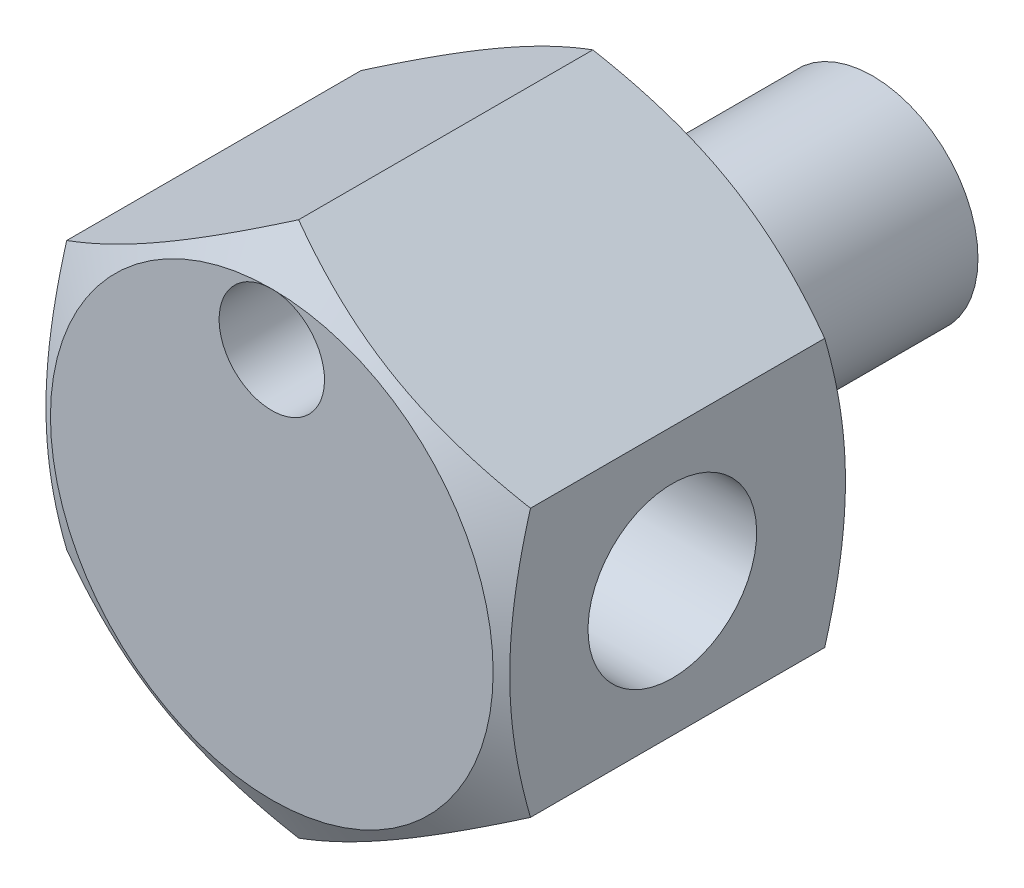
ISO-10303-21;
HEADER;
FILE_DESCRIPTION(('STEP AP214'),'2;1');
FILE_NAME('part.step','',(''),(''),'','','');
FILE_SCHEMA(('AUTOMOTIVE_DESIGN { 1 0 10303 214 1 1 1 1 }'));
ENDSEC;
DATA;
#1=APPLICATION_CONTEXT('core data for automotive mechanical design processes');
#2=APPLICATION_PROTOCOL_DEFINITION('international standard','automotive_design',2000,#1);
#3=PRODUCT_CONTEXT('',#1,'mechanical');
#4=PRODUCT('Part','Part','',(#3));
#5=PRODUCT_RELATED_PRODUCT_CATEGORY('part','',(#4));
#6=PRODUCT_DEFINITION_FORMATION('','',#4);
#7=PRODUCT_DEFINITION_CONTEXT('part definition',#1,'design');
#8=PRODUCT_DEFINITION('design','',#6,#7);
#9=PRODUCT_DEFINITION_SHAPE('','',#8);
#10=(LENGTH_UNIT() NAMED_UNIT(*) SI_UNIT(.MILLI.,.METRE.));
#11=(NAMED_UNIT(*) PLANE_ANGLE_UNIT() SI_UNIT($,.RADIAN.));
#12=(NAMED_UNIT(*) SI_UNIT($,.STERADIAN.) SOLID_ANGLE_UNIT());
#13=UNCERTAINTY_MEASURE_WITH_UNIT(LENGTH_MEASURE(1.E-05),#10,'distance_accuracy_value','');
#14=(GEOMETRIC_REPRESENTATION_CONTEXT(3) GLOBAL_UNCERTAINTY_ASSIGNED_CONTEXT((#13)) GLOBAL_UNIT_ASSIGNED_CONTEXT((#10,
#11,#12)) REPRESENTATION_CONTEXT('',''));
#15=CARTESIAN_POINT('',(0.,0.,0.));
#16=DIRECTION('',(0.,0.,1.));
#17=DIRECTION('',(1.,0.,0.));
#18=AXIS2_PLACEMENT_3D('',#15,#16,#17);
#19=CARTESIAN_POINT('',(-11.,0.,8.5));
#20=DIRECTION('',(-1.,0.,0.));
#21=DIRECTION('',(0.,-1.,0.));
#22=AXIS2_PLACEMENT_3D('',#19,#20,#21);
#23=CYLINDRICAL_SURFACE('',#22,4.);
#24=CARTESIAN_POINT('',(11.,0.,8.5));
#25=DIRECTION('',(-1.,0.,0.));
#26=DIRECTION('',(0.,-1.,0.));
#27=AXIS2_PLACEMENT_3D('',#24,#25,#26);
#28=CIRCLE('',#27,4.);
#29=CARTESIAN_POINT('',(11.,-4.,8.5));
#30=VERTEX_POINT('',#29);
#31=EDGE_CURVE('E370',#30,#30,#28,.T.);
#32=ORIENTED_EDGE('',*,*,#31,.F.);
#33=EDGE_LOOP('',(#32));
#34=FACE_BOUND('',#33,.T.);
#35=CARTESIAN_POINT('',(-11.,0.,8.5));
#36=DIRECTION('',(-1.,0.,0.));
#37=DIRECTION('',(0.,-1.,0.));
#38=AXIS2_PLACEMENT_3D('',#35,#36,#37);
#39=CIRCLE('',#38,4.);
#40=CARTESIAN_POINT('',(-11.,-4.,8.5));
#41=VERTEX_POINT('',#40);
#42=EDGE_CURVE('E367',#41,#41,#39,.T.);
#43=ORIENTED_EDGE('',*,*,#42,.T.);
#44=EDGE_LOOP('',(#43));
#45=FACE_BOUND('',#44,.T.);
#46=ADVANCED_FACE('F14',(#34,#45),#23,.F.);
#47=CARTESIAN_POINT('',(0.,0.,-12.));
#48=DIRECTION('',(0.,0.,-1.));
#49=DIRECTION('',(-1.,0.,0.));
#50=AXIS2_PLACEMENT_3D('',#47,#48,#49);
#51=PLANE('',#50);
#52=CARTESIAN_POINT('',(0.,0.,-12.));
#53=DIRECTION('',(0.,0.,-1.));
#54=DIRECTION('',(-1.,0.,0.));
#55=AXIS2_PLACEMENT_3D('',#52,#53,#54);
#56=CIRCLE('',#55,5.);
#57=CARTESIAN_POINT('',(-5.,0.,-12.));
#58=VERTEX_POINT('',#57);
#59=EDGE_CURVE('E364',#58,#58,#56,.T.);
#60=ORIENTED_EDGE('',*,*,#59,.T.);
#61=EDGE_LOOP('',(#60));
#62=FACE_BOUND('',#61,.T.);
#63=ADVANCED_FACE('F294',(#62),#51,.T.);
#64=CARTESIAN_POINT('',(11.,-6.35085296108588,16.5));
#65=DIRECTION('',(-1.,0.,0.));
#66=DIRECTION('',(0.,-1.,0.));
#67=AXIS2_PLACEMENT_3D('',#64,#65,#66);
#68=PLANE('',#67);
#69=ORIENTED_EDGE('',*,*,#31,.T.);
#70=EDGE_LOOP('',(#69));
#71=FACE_BOUND('',#70,.T.);
#72=DIRECTION('',(0.,0.,-1.));
#73=VECTOR('',#72,1.);
#74=CARTESIAN_POINT('',(11.,6.3508529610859,16.5));
#75=LINE('',#74,#73);
#76=CARTESIAN_POINT('',(11.,6.3508529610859,15.2288444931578));
#77=VERTEX_POINT('',#76);
#78=CARTESIAN_POINT('',(11.,6.3508529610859,1.27115550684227));
#79=VERTEX_POINT('',#78);
#80=EDGE_CURVE('E351',#77,#79,#75,.T.);
#81=ORIENTED_EDGE('',*,*,#80,.F.);
#82=CARTESIAN_POINT('',(11.,-16.803391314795,10.9668632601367));
#83=CARTESIAN_POINT('',(11.,-16.5620742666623,11.0834292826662));
#84=CARTESIAN_POINT('',(11.,-16.3204643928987,11.1993887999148));
#85=CARTESIAN_POINT('',(11.,-15.8365971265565,11.4299555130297));
#86=CARTESIAN_POINT('',(11.,-15.5943397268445,11.544562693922));
#87=CARTESIAN_POINT('',(11.,-14.8664318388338,11.8861802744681));
#88=CARTESIAN_POINT('',(11.,-14.379724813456,12.1109483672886));
#89=CARTESIAN_POINT('',(11.,-13.4001281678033,12.5543406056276));
#90=CARTESIAN_POINT('',(11.,-12.9072190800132,12.772921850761));
#91=CARTESIAN_POINT('',(11.,-11.917335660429,13.2006416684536));
#92=CARTESIAN_POINT('',(11.,-11.4203615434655,13.4097807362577));
#93=CARTESIAN_POINT('',(11.,-10.4155733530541,13.8185042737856));
#94=CARTESIAN_POINT('',(11.,-9.90770066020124,14.0179454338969));
#95=CARTESIAN_POINT('',(11.,-8.88595211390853,14.4011078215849));
#96=CARTESIAN_POINT('',(11.,-8.37207559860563,14.5848272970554));
#97=CARTESIAN_POINT('',(11.,-7.3385643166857,14.9315794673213));
#98=CARTESIAN_POINT('',(11.,-6.81894458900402,15.0946564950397));
#99=CARTESIAN_POINT('',(11.,-5.77233865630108,15.3948046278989));
#100=CARTESIAN_POINT('',(11.,-5.24535484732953,15.5318839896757));
#101=CARTESIAN_POINT('',(11.,-4.18355667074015,15.7733499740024));
#102=CARTESIAN_POINT('',(11.,-3.64873977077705,15.8777257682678));
#103=CARTESIAN_POINT('',(11.,-2.84184292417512,16.0045125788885));
#104=CARTESIAN_POINT('',(11.,-2.57206571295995,16.0418147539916));
#105=CARTESIAN_POINT('',(11.,-2.0312594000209,16.1057590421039));
#106=CARTESIAN_POINT('',(11.,-1.7602304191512,16.1324021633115));
#107=CARTESIAN_POINT('',(11.,-1.21898438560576,16.1743130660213));
#108=CARTESIAN_POINT('',(11.,-0.948772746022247,16.189650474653));
#109=CARTESIAN_POINT('',(11.,-0.40794323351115,16.2088695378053));
#110=CARTESIAN_POINT('',(11.,-0.137325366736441,16.2127513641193));
#111=CARTESIAN_POINT('',(11.,0.403755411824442,16.2089669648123));
#112=CARTESIAN_POINT('',(11.,0.674218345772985,16.2013039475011));
#113=CARTESIAN_POINT('',(11.,1.21458707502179,16.1746193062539));
#114=CARTESIAN_POINT('',(11.,1.48449283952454,16.1555970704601));
#115=CARTESIAN_POINT('',(11.,2.13975155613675,16.0960223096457));
#116=CARTESIAN_POINT('',(11.,2.52459164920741,16.0497180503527));
#117=CARTESIAN_POINT('',(11.,3.29123006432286,15.93660398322));
#118=CARTESIAN_POINT('',(11.,3.67302792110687,15.8697910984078));
#119=CARTESIAN_POINT('',(11.,4.81453751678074,15.6419434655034));
#120=CARTESIAN_POINT('',(11.,5.56887050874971,15.4536528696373));
#121=CARTESIAN_POINT('',(11.,6.69714810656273,15.1293211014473));
#122=CARTESIAN_POINT('',(11.,7.07699619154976,15.0126543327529));
#123=CARTESIAN_POINT('',(11.,7.83302288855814,14.7677701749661));
#124=CARTESIAN_POINT('',(11.,8.20920116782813,14.6395517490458));
#125=CARTESIAN_POINT('',(11.,8.95600996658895,14.3743055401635));
#126=CARTESIAN_POINT('',(11.,9.32665982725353,14.237331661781));
#127=CARTESIAN_POINT('',(11.,10.0648107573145,13.9555037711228));
#128=CARTESIAN_POINT('',(11.,10.4323128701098,13.8106524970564));
#129=CARTESIAN_POINT('',(11.,10.7984905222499,13.6626011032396));
#130=B_SPLINE_CURVE_WITH_KNOTS('',3,(#82,#83,#84,#85,#86,#87,#88,#89,#90,#91,#92,#93,#94,#95,
#96,#97,#98,#99,#100,#101,#102,#103,#104,#105,#106,#107,#108,#109,#110,#111,#112,#113,#114,#115,
#116,#117,#118,#119,#120,#121,#122,#123,#124,#125,#126,#127,#128,#129),.UNSPECIFIED.,.F.,.F.,(4,
2,2,2,2,2,2,2,2,2,2,2,2,2,2,2,2,2,2,2,2,2,2,4),(0.,0.803984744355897,1.60797838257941,
3.21622949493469,4.83375407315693,6.45119371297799,8.08788018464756,9.72474882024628,
11.3580401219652,12.9908118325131,14.6241235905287,15.4409776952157,16.2577545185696,
17.0694581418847,17.8811495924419,18.6926155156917,19.5041251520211,20.6663113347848,
21.8286719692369,24.1578810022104,25.3498722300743,26.5419705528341,27.7273290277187,
28.912278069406),.UNSPECIFIED.);
#131=CARTESIAN_POINT('',(11.,-6.35085296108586,15.2288444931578));
#132=VERTEX_POINT('',#131);
#133=EDGE_CURVE('E231',#77,#132,#130,.F.);
#134=ORIENTED_EDGE('',*,*,#133,.T.);
#135=DIRECTION('',(0.,0.,-1.));
#136=VECTOR('',#135,1.);
#137=CARTESIAN_POINT('',(11.,-6.35085296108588,16.5));
#138=LINE('',#137,#136);
#139=CARTESIAN_POINT('',(11.,-6.35085296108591,1.27115550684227));
#140=VERTEX_POINT('',#139);
#141=EDGE_CURVE('E353',#132,#140,#138,.T.);
#142=ORIENTED_EDGE('',*,*,#141,.T.);
#143=CARTESIAN_POINT('',(11.,-16.803391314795,5.53313673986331));
#144=CARTESIAN_POINT('',(11.,-16.5620742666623,5.41657071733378));
#145=CARTESIAN_POINT('',(11.,-16.3204643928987,5.30061120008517));
#146=CARTESIAN_POINT('',(11.,-15.8365971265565,5.07004448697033));
#147=CARTESIAN_POINT('',(11.,-15.5943397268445,4.95543730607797));
#148=CARTESIAN_POINT('',(11.,-14.8664318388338,4.6138197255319));
#149=CARTESIAN_POINT('',(11.,-14.379724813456,4.38905163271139));
#150=CARTESIAN_POINT('',(11.,-13.4001281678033,3.94565939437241));
#151=CARTESIAN_POINT('',(11.,-12.9072190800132,3.72707814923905));
#152=CARTESIAN_POINT('',(11.,-11.917335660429,3.29935833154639));
#153=CARTESIAN_POINT('',(11.,-11.4203615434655,3.09021926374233));
#154=CARTESIAN_POINT('',(11.,-10.4155733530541,2.68149572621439));
#155=CARTESIAN_POINT('',(11.,-9.90770066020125,2.48205456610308));
#156=CARTESIAN_POINT('',(11.,-8.88595211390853,2.09889217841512));
#157=CARTESIAN_POINT('',(11.,-8.37207559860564,1.91517270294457));
#158=CARTESIAN_POINT('',(11.,-7.3385643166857,1.56842053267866));
#159=CARTESIAN_POINT('',(11.,-6.81894458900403,1.40534350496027));
#160=CARTESIAN_POINT('',(11.,-5.77233865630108,1.10519537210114));
#161=CARTESIAN_POINT('',(11.,-5.24535484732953,0.968116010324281));
#162=CARTESIAN_POINT('',(11.,-4.18355667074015,0.726650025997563));
#163=CARTESIAN_POINT('',(11.,-3.64873977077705,0.622274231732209));
#164=CARTESIAN_POINT('',(11.,-2.84184292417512,0.495487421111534));
#165=CARTESIAN_POINT('',(11.,-2.57206571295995,0.458185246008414));
#166=CARTESIAN_POINT('',(11.,-2.03125940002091,0.394240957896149));
#167=CARTESIAN_POINT('',(11.,-1.7602304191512,0.367597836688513));
#168=CARTESIAN_POINT('',(11.,-1.21898438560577,0.325686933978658));
#169=CARTESIAN_POINT('',(11.,-0.948772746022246,0.310349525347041));
#170=CARTESIAN_POINT('',(11.,-0.407943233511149,0.291130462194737));
#171=CARTESIAN_POINT('',(11.,-0.137325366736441,0.287248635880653));
#172=CARTESIAN_POINT('',(11.,0.403755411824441,0.291033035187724));
#173=CARTESIAN_POINT('',(11.,0.674218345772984,0.298696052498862));
#174=CARTESIAN_POINT('',(11.,1.21458707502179,0.325380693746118));
#175=CARTESIAN_POINT('',(11.,1.48449283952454,0.34440292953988));
#176=CARTESIAN_POINT('',(11.,2.13975155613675,0.403977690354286));
#177=CARTESIAN_POINT('',(11.,2.52459164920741,0.450281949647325));
#178=CARTESIAN_POINT('',(11.,3.29123006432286,0.563396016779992));
#179=CARTESIAN_POINT('',(11.,3.67302792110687,0.630208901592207));
#180=CARTESIAN_POINT('',(11.,4.81453751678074,0.858056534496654));
#181=CARTESIAN_POINT('',(11.,5.56887050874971,1.04634713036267));
#182=CARTESIAN_POINT('',(11.,6.69714810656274,1.37067889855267));
#183=CARTESIAN_POINT('',(11.,7.07699619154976,1.48734566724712));
#184=CARTESIAN_POINT('',(11.,7.83302288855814,1.73222982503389));
#185=CARTESIAN_POINT('',(11.,8.20920116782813,1.86044825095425));
#186=CARTESIAN_POINT('',(11.,8.95600996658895,2.12569445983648));
#187=CARTESIAN_POINT('',(11.,9.32665982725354,2.26266833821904));
#188=CARTESIAN_POINT('',(11.,10.0648107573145,2.54449622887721));
#189=CARTESIAN_POINT('',(11.,10.4323128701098,2.68934750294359));
#190=CARTESIAN_POINT('',(11.,10.7984905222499,2.83739889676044));
#191=B_SPLINE_CURVE_WITH_KNOTS('',3,(#143,#144,#145,#146,#147,#148,#149,#150,#151,#152,#153,
#154,#155,#156,#157,#158,#159,#160,#161,#162,#163,#164,#165,#166,#167,#168,#169,#170,#171,#172,
#173,#174,#175,#176,#177,#178,#179,#180,#181,#182,#183,#184,#185,#186,#187,#188,#189,#190),
.UNSPECIFIED.,.F.,.F.,(4,2,2,2,2,2,2,2,2,2,2,2,2,2,2,2,2,2,2,2,2,2,2,4),(0.,0.803984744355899,
1.60797838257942,3.21622949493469,4.83375407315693,6.45119371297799,8.08788018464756,
9.72474882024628,11.3580401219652,12.9908118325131,14.6241235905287,15.4409776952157,
16.2577545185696,17.0694581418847,17.8811495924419,18.6926155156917,19.5041251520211,
20.6663113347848,21.8286719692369,24.1578810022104,25.3498722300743,26.5419705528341,
27.7273290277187,28.912278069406),.UNSPECIFIED.);
#192=EDGE_CURVE('E328',#140,#79,#191,.T.);
#193=ORIENTED_EDGE('',*,*,#192,.T.);
#194=EDGE_LOOP('',(#81,#134,#142,#193));
#195=FACE_BOUND('',#194,.T.);
#196=ADVANCED_FACE('F242',(#71,#195),#68,.F.);
#197=CARTESIAN_POINT('',(0.,-12.7017059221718,16.5));
#198=DIRECTION('',(-0.5,0.866025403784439,0.));
#199=DIRECTION('',(-0.866025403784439,-0.5,0.));
#200=AXIS2_PLACEMENT_3D('',#197,#198,#199);
#201=PLANE('',#200);
#202=ORIENTED_EDGE('',*,*,#141,.F.);
#203=CARTESIAN_POINT('',(11.0002,-6.35073749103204,15.228777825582));
#204=CARTESIAN_POINT('',(10.7583962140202,-6.49034297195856,15.3093657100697));
#205=CARTESIAN_POINT('',(10.515690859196,-6.63046897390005,15.3862959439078));
#206=CARTESIAN_POINT('',(10.0283338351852,-6.91184468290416,15.5318262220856));
#207=CARTESIAN_POINT('',(9.78368155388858,-7.05309474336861,15.6004235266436));
#208=CARTESIAN_POINT('',(9.0457826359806,-7.47912088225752,15.792388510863));
#209=CARTESIAN_POINT('',(8.54962304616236,-7.76557875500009,15.9015771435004));
#210=CARTESIAN_POINT('',(7.80714296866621,-8.19424982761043,16.0296107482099));
#211=CARTESIAN_POINT('',(7.56304065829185,-8.33518236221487,16.0660826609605));
#212=CARTESIAN_POINT('',(7.07370581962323,-8.61769996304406,16.1272435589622));
#213=CARTESIAN_POINT('',(6.82847326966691,-8.7592850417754,16.1519323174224));
#214=CARTESIAN_POINT('',(6.33759931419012,-9.0426912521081,16.1888945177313));
#215=CARTESIAN_POINT('',(6.09195874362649,-9.18451190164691,16.2011827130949));
#216=CARTESIAN_POINT('',(5.60044998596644,-9.468284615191,16.2130819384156));
#217=CARTESIAN_POINT('',(5.35458180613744,-9.61023667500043,16.2126933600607));
#218=CARTESIAN_POINT('',(4.89492981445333,-9.87561687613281,16.2001236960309));
#219=CARTESIAN_POINT('',(4.68111322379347,-9.99906394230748,16.1894758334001));
#220=CARTESIAN_POINT('',(4.25397181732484,-10.2456741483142,16.1587932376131));
#221=CARTESIAN_POINT('',(4.0406470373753,-10.3688372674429,16.1387578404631));
#222=CARTESIAN_POINT('',(3.61460518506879,-10.6148126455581,16.0896494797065));
#223=CARTESIAN_POINT('',(3.40188876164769,-10.7376245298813,16.0605690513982));
#224=CARTESIAN_POINT('',(2.97745318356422,-10.9826725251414,15.9938808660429));
#225=CARTESIAN_POINT('',(2.76573409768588,-11.1049085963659,15.956272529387));
#226=CARTESIAN_POINT('',(2.12304886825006,-11.4759630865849,15.8297049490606));
#227=CARTESIAN_POINT('',(1.69394387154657,-11.7237069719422,15.7281254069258));
#228=CARTESIAN_POINT('',(0.842132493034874,-12.2155005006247,15.4975811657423));
#229=CARTESIAN_POINT('',(0.419415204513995,-12.4595564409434,15.3686706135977));
#230=CARTESIAN_POINT('',(-0.000200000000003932,-12.7018213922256,15.228777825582));
#231=B_SPLINE_CURVE_WITH_KNOTS('',3,(#203,#204,#205,#206,#207,#208,#209,#210,#211,#212,#213,
#214,#215,#216,#217,#218,#219,#220,#221,#222,#223,#224,#225,#226,#227,#228,#229,#230),
.UNSPECIFIED.,.F.,.F.,(4,2,2,2,2,2,2,2,2,2,2,2,2,4),(0.,0.871755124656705,1.74379610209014,
3.49159027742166,4.34403665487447,5.19649943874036,6.04794680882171,6.89936787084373,
7.64056020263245,8.38180496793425,9.12366309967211,9.86557166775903,11.3820155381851,
12.8954827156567),.UNSPECIFIED.);
#232=CARTESIAN_POINT('',(0.,-12.7017059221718,15.2288444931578));
#233=VERTEX_POINT('',#232);
#234=EDGE_CURVE('E224',#132,#233,#231,.T.);
#235=ORIENTED_EDGE('',*,*,#234,.T.);
#236=DIRECTION('',(0.,0.,-1.));
#237=VECTOR('',#236,1.);
#238=CARTESIAN_POINT('',(0.,-12.7017059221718,16.5));
#239=LINE('',#238,#237);
#240=CARTESIAN_POINT('',(0.,-12.7017059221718,1.27115550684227));
#241=VERTEX_POINT('',#240);
#242=EDGE_CURVE('E358',#233,#241,#239,.T.);
#243=ORIENTED_EDGE('',*,*,#242,.T.);
#244=CARTESIAN_POINT('',(-0.000200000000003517,-12.7018213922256,1.27122217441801));
#245=CARTESIAN_POINT('',(0.241603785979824,-12.5622159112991,1.19063428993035));
#246=CARTESIAN_POINT('',(0.484309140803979,-12.4220899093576,1.11370405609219));
#247=CARTESIAN_POINT('',(0.971666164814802,-12.1407142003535,0.968173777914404));
#248=CARTESIAN_POINT('',(1.21631844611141,-11.999464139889,0.899576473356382));
#249=CARTESIAN_POINT('',(1.9542173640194,-11.5734380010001,0.707611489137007));
#250=CARTESIAN_POINT('',(2.45037695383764,-11.2869801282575,0.598422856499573));
#251=CARTESIAN_POINT('',(3.19285703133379,-10.8583090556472,0.470389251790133));
#252=CARTESIAN_POINT('',(3.43695934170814,-10.7173765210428,0.433917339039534));
#253=CARTESIAN_POINT('',(3.92629418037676,-10.4348589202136,0.372756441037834));
#254=CARTESIAN_POINT('',(4.17152673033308,-10.2932738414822,0.348067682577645));
#255=CARTESIAN_POINT('',(4.66240068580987,-10.0098676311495,0.311105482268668));
#256=CARTESIAN_POINT('',(4.9080412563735,-9.86804698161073,0.298817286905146));
#257=CARTESIAN_POINT('',(5.39955001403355,-9.58427426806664,0.286918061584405));
#258=CARTESIAN_POINT('',(5.64541819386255,-9.44232220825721,0.287306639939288));
#259=CARTESIAN_POINT('',(6.10507018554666,-9.17694200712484,0.299876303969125));
#260=CARTESIAN_POINT('',(6.31888677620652,-9.05349494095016,0.31052416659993));
#261=CARTESIAN_POINT('',(6.74602818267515,-8.80688473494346,0.34120676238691));
#262=CARTESIAN_POINT('',(6.95935296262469,-8.68372161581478,0.36124215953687));
#263=CARTESIAN_POINT('',(7.3853948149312,-8.43774623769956,0.410350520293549));
#264=CARTESIAN_POINT('',(7.5981112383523,-8.31493435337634,0.439430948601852));
#265=CARTESIAN_POINT('',(8.02254681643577,-8.06988635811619,0.506119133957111));
#266=CARTESIAN_POINT('',(8.23426590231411,-7.94765028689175,0.543727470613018));
#267=CARTESIAN_POINT('',(8.87695113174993,-7.57659579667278,0.670295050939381));
#268=CARTESIAN_POINT('',(9.30605612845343,-7.32885191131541,0.771874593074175));
#269=CARTESIAN_POINT('',(10.1578675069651,-6.8370583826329,1.00241883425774));
#270=CARTESIAN_POINT('',(10.580584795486,-6.59300244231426,1.13132938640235));
#271=CARTESIAN_POINT('',(11.0002,-6.35073749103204,1.27122217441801));
#272=B_SPLINE_CURVE_WITH_KNOTS('',3,(#244,#245,#246,#247,#248,#249,#250,#251,#252,#253,#254,
#255,#256,#257,#258,#259,#260,#261,#262,#263,#264,#265,#266,#267,#268,#269,#270,#271),
.UNSPECIFIED.,.F.,.F.,(4,2,2,2,2,2,2,2,2,2,2,2,2,4),(0.,0.871755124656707,1.74379610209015,
3.49159027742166,4.34403665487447,5.19649943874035,6.0479468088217,6.89936787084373,
7.64056020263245,8.38180496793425,9.1236630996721,9.86557166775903,11.3820155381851,
12.8954827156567),.UNSPECIFIED.);
#273=EDGE_CURVE('E249',#241,#140,#272,.T.);
#274=ORIENTED_EDGE('',*,*,#273,.T.);
#275=EDGE_LOOP('',(#202,#235,#243,#274));
#276=FACE_BOUND('',#275,.T.);
#277=ADVANCED_FACE('F238',(#276),#201,.F.);
#278=CARTESIAN_POINT('',(-11.,-6.35085296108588,16.5));
#279=DIRECTION('',(0.5,0.866025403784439,0.));
#280=DIRECTION('',(-0.866025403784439,0.5,0.));
#281=AXIS2_PLACEMENT_3D('',#278,#279,#280);
#282=PLANE('',#281);
#283=ORIENTED_EDGE('',*,*,#242,.F.);
#284=CARTESIAN_POINT('',(0.000199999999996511,-12.7018213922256,15.228777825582));
#285=CARTESIAN_POINT('',(-0.241603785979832,-12.5622159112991,15.3093657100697));
#286=CARTESIAN_POINT('',(-0.484309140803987,-12.4220899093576,15.3862959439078));
#287=CARTESIAN_POINT('',(-0.97166616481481,-12.1407142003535,15.5318262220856));
#288=CARTESIAN_POINT('',(-1.21631844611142,-11.999464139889,15.6004235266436));
#289=CARTESIAN_POINT('',(-1.9542173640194,-11.5734380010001,15.792388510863));
#290=CARTESIAN_POINT('',(-2.45037695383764,-11.2869801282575,15.9015771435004));
#291=CARTESIAN_POINT('',(-3.19285703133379,-10.8583090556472,16.0296107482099));
#292=CARTESIAN_POINT('',(-3.43695934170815,-10.7173765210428,16.0660826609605));
#293=CARTESIAN_POINT('',(-3.92629418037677,-10.4348589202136,16.1272435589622));
#294=CARTESIAN_POINT('',(-4.17152673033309,-10.2932738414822,16.1519323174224));
#295=CARTESIAN_POINT('',(-4.66240068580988,-10.0098676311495,16.1888945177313));
#296=CARTESIAN_POINT('',(-4.90804125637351,-9.86804698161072,16.2011827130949));
#297=CARTESIAN_POINT('',(-5.39955001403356,-9.58427426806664,16.2130819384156));
#298=CARTESIAN_POINT('',(-5.64541819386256,-9.44232220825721,16.2126933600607));
#299=CARTESIAN_POINT('',(-6.10507018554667,-9.17694200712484,16.2001236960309));
#300=CARTESIAN_POINT('',(-6.31888677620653,-9.05349494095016,16.1894758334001));
#301=CARTESIAN_POINT('',(-6.74602818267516,-8.80688473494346,16.1587932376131));
#302=CARTESIAN_POINT('',(-6.9593529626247,-8.68372161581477,16.1387578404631));
#303=CARTESIAN_POINT('',(-7.38539481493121,-8.43774623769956,16.0896494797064));
#304=CARTESIAN_POINT('',(-7.59811123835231,-8.31493435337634,16.0605690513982));
#305=CARTESIAN_POINT('',(-8.02254681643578,-8.06988635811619,15.9938808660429));
#306=CARTESIAN_POINT('',(-8.23426590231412,-7.94765028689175,15.956272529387));
#307=CARTESIAN_POINT('',(-8.87695113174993,-7.57659579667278,15.8297049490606));
#308=CARTESIAN_POINT('',(-9.30605612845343,-7.32885191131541,15.7281254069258));
#309=CARTESIAN_POINT('',(-10.1578675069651,-6.8370583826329,15.4975811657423));
#310=CARTESIAN_POINT('',(-10.580584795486,-6.59300244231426,15.3686706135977));
#311=CARTESIAN_POINT('',(-11.0002,-6.35073749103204,15.228777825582));
#312=B_SPLINE_CURVE_WITH_KNOTS('',3,(#284,#285,#286,#287,#288,#289,#290,#291,#292,#293,#294,
#295,#296,#297,#298,#299,#300,#301,#302,#303,#304,#305,#306,#307,#308,#309,#310,#311),
.UNSPECIFIED.,.F.,.F.,(4,2,2,2,2,2,2,2,2,2,2,2,2,4),(0.,0.871755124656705,1.74379610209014,
3.49159027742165,4.34403665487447,5.19649943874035,6.0479468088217,6.89936787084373,
7.64056020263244,8.38180496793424,9.1236630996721,9.86557166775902,11.3820155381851,
12.8954827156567),.UNSPECIFIED.);
#313=CARTESIAN_POINT('',(-11.,-6.35085296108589,15.2288444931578));
#314=VERTEX_POINT('',#313);
#315=EDGE_CURVE('E217',#233,#314,#312,.T.);
#316=ORIENTED_EDGE('',*,*,#315,.T.);
#317=DIRECTION('',(0.,0.,-1.));
#318=VECTOR('',#317,1.);
#319=CARTESIAN_POINT('',(-11.,-6.35085296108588,16.5));
#320=LINE('',#319,#318);
#321=CARTESIAN_POINT('',(-11.,-6.35085296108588,1.27115550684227));
#322=VERTEX_POINT('',#321);
#323=EDGE_CURVE('E341',#314,#322,#320,.T.);
#324=ORIENTED_EDGE('',*,*,#323,.T.);
#325=CARTESIAN_POINT('',(-11.0002,-6.35073749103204,1.27122217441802));
#326=CARTESIAN_POINT('',(-10.7583962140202,-6.49034297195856,1.19063428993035));
#327=CARTESIAN_POINT('',(-10.515690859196,-6.63046897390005,1.1137040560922));
#328=CARTESIAN_POINT('',(-10.0283338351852,-6.91184468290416,0.968173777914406));
#329=CARTESIAN_POINT('',(-9.78368155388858,-7.05309474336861,0.899576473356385));
#330=CARTESIAN_POINT('',(-9.0457826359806,-7.47912088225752,0.70761148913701));
#331=CARTESIAN_POINT('',(-8.54962304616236,-7.76557875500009,0.598422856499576));
#332=CARTESIAN_POINT('',(-7.80714296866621,-8.19424982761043,0.470389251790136));
#333=CARTESIAN_POINT('',(-7.56304065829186,-8.33518236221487,0.433917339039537));
#334=CARTESIAN_POINT('',(-7.07370581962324,-8.61769996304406,0.372756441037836));
#335=CARTESIAN_POINT('',(-6.82847326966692,-8.7592850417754,0.348067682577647));
#336=CARTESIAN_POINT('',(-6.33759931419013,-9.0426912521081,0.31110548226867));
#337=CARTESIAN_POINT('',(-6.0919587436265,-9.18451190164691,0.298817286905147));
#338=CARTESIAN_POINT('',(-5.60044998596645,-9.468284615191,0.286918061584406));
#339=CARTESIAN_POINT('',(-5.35458180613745,-9.61023667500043,0.28730663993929));
#340=CARTESIAN_POINT('',(-4.89492981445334,-9.87561687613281,0.299876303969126));
#341=CARTESIAN_POINT('',(-4.68111322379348,-9.99906394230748,0.310524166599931));
#342=CARTESIAN_POINT('',(-4.25397181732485,-10.2456741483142,0.34120676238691));
#343=CARTESIAN_POINT('',(-4.04064703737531,-10.3688372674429,0.36124215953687));
#344=CARTESIAN_POINT('',(-3.6146051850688,-10.6148126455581,0.41035052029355));
#345=CARTESIAN_POINT('',(-3.4018887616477,-10.7376245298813,0.439430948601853));
#346=CARTESIAN_POINT('',(-2.97745318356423,-10.9826725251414,0.506119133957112));
#347=CARTESIAN_POINT('',(-2.76573409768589,-11.1049085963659,0.543727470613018));
#348=CARTESIAN_POINT('',(-2.12304886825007,-11.4759630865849,0.670295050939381));
#349=CARTESIAN_POINT('',(-1.69394387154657,-11.7237069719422,0.771874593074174));
#350=CARTESIAN_POINT('',(-0.842132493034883,-12.2155005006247,1.00241883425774));
#351=CARTESIAN_POINT('',(-0.419415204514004,-12.4595564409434,1.13132938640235));
#352=CARTESIAN_POINT('',(0.00019999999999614,-12.7018213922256,1.27122217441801));
#353=B_SPLINE_CURVE_WITH_KNOTS('',3,(#325,#326,#327,#328,#329,#330,#331,#332,#333,#334,#335,
#336,#337,#338,#339,#340,#341,#342,#343,#344,#345,#346,#347,#348,#349,#350,#351,#352),
.UNSPECIFIED.,.F.,.F.,(4,2,2,2,2,2,2,2,2,2,2,2,2,4),(0.,0.871755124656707,1.74379610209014,
3.49159027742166,4.34403665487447,5.19649943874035,6.0479468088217,6.89936787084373,
7.64056020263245,8.38180496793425,9.1236630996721,9.86557166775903,11.3820155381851,
12.8954827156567),.UNSPECIFIED.);
#354=EDGE_CURVE('E256',#322,#241,#353,.T.);
#355=ORIENTED_EDGE('',*,*,#354,.T.);
#356=EDGE_LOOP('',(#283,#316,#324,#355));
#357=FACE_BOUND('',#356,.T.);
#358=ADVANCED_FACE('F241',(#357),#282,.F.);
#359=CARTESIAN_POINT('',(-11.,6.35085296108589,16.5));
#360=DIRECTION('',(1.,0.,0.));
#361=DIRECTION('',(0.,1.,0.));
#362=AXIS2_PLACEMENT_3D('',#359,#360,#361);
#363=PLANE('',#362);
#364=ORIENTED_EDGE('',*,*,#42,.F.);
#365=EDGE_LOOP('',(#364));
#366=FACE_BOUND('',#365,.T.);
#367=ORIENTED_EDGE('',*,*,#323,.F.);
#368=CARTESIAN_POINT('',(-11.,-16.803391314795,10.9668632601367));
#369=CARTESIAN_POINT('',(-11.,-16.5620742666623,11.0834292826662));
#370=CARTESIAN_POINT('',(-11.,-16.3204643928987,11.1993887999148));
#371=CARTESIAN_POINT('',(-11.,-15.8365971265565,11.4299555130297));
#372=CARTESIAN_POINT('',(-11.,-15.5943397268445,11.544562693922));
#373=CARTESIAN_POINT('',(-11.,-14.8664318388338,11.8861802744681));
#374=CARTESIAN_POINT('',(-11.,-14.379724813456,12.1109483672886));
#375=CARTESIAN_POINT('',(-11.,-13.4001281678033,12.5543406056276));
#376=CARTESIAN_POINT('',(-11.,-12.9072190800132,12.772921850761));
#377=CARTESIAN_POINT('',(-11.,-11.917335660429,13.2006416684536));
#378=CARTESIAN_POINT('',(-11.,-11.4203615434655,13.4097807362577));
#379=CARTESIAN_POINT('',(-11.,-10.4155733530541,13.8185042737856));
#380=CARTESIAN_POINT('',(-11.,-9.90770066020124,14.0179454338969));
#381=CARTESIAN_POINT('',(-11.,-8.88595211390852,14.4011078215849));
#382=CARTESIAN_POINT('',(-11.,-8.37207559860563,14.5848272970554));
#383=CARTESIAN_POINT('',(-11.,-7.33856431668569,14.9315794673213));
#384=CARTESIAN_POINT('',(-11.,-6.81894458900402,15.0946564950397));
#385=CARTESIAN_POINT('',(-11.,-5.77233865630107,15.3948046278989));
#386=CARTESIAN_POINT('',(-11.,-5.24535484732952,15.5318839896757));
#387=CARTESIAN_POINT('',(-11.,-4.18355667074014,15.7733499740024));
#388=CARTESIAN_POINT('',(-11.,-3.64873977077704,15.8777257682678));
#389=CARTESIAN_POINT('',(-11.,-2.84184292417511,16.0045125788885));
#390=CARTESIAN_POINT('',(-11.,-2.57206571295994,16.0418147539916));
#391=CARTESIAN_POINT('',(-11.,-2.0312594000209,16.1057590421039));
#392=CARTESIAN_POINT('',(-11.,-1.7602304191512,16.1324021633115));
#393=CARTESIAN_POINT('',(-11.,-1.21898438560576,16.1743130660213));
#394=CARTESIAN_POINT('',(-11.,-0.94877274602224,16.189650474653));
#395=CARTESIAN_POINT('',(-11.,-0.407943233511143,16.2088695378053));
#396=CARTESIAN_POINT('',(-11.,-0.137325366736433,16.2127513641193));
#397=CARTESIAN_POINT('',(-11.,0.40375541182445,16.2089669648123));
#398=CARTESIAN_POINT('',(-11.,0.674218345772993,16.2013039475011));
#399=CARTESIAN_POINT('',(-11.,1.21458707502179,16.1746193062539));
#400=CARTESIAN_POINT('',(-11.,1.48449283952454,16.1555970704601));
#401=CARTESIAN_POINT('',(-11.,2.13975155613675,16.0960223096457));
#402=CARTESIAN_POINT('',(-11.,2.52459164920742,16.0497180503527));
#403=CARTESIAN_POINT('',(-11.,3.29123006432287,15.93660398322));
#404=CARTESIAN_POINT('',(-11.,3.67302792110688,15.8697910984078));
#405=CARTESIAN_POINT('',(-11.,4.81453751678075,15.6419434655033));
#406=CARTESIAN_POINT('',(-11.,5.56887050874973,15.4536528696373));
#407=CARTESIAN_POINT('',(-11.,6.69714810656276,15.1293211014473));
#408=CARTESIAN_POINT('',(-11.,7.07699619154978,15.0126543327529));
#409=CARTESIAN_POINT('',(-11.,7.83302288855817,14.7677701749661));
#410=CARTESIAN_POINT('',(-11.,8.20920116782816,14.6395517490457));
#411=CARTESIAN_POINT('',(-11.,8.95600996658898,14.3743055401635));
#412=CARTESIAN_POINT('',(-11.,9.32665982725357,14.2373316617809));
#413=CARTESIAN_POINT('',(-11.,10.0648107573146,13.9555037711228));
#414=CARTESIAN_POINT('',(-11.,10.4323128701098,13.8106524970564));
#415=CARTESIAN_POINT('',(-11.,10.7984905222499,13.6626011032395));
#416=B_SPLINE_CURVE_WITH_KNOTS('',3,(#368,#369,#370,#371,#372,#373,#374,#375,#376,#377,#378,
#379,#380,#381,#382,#383,#384,#385,#386,#387,#388,#389,#390,#391,#392,#393,#394,#395,#396,#397,
#398,#399,#400,#401,#402,#403,#404,#405,#406,#407,#408,#409,#410,#411,#412,#413,#414,#415),
.UNSPECIFIED.,.F.,.F.,(4,2,2,2,2,2,2,2,2,2,2,2,2,2,2,2,2,2,2,2,2,2,2,4),(0.,0.803984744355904,
1.60797838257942,3.21622949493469,4.83375407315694,6.451193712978,8.08788018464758,
9.7247488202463,11.3580401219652,12.9908118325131,14.6241235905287,15.4409776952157,
16.2577545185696,17.0694581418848,17.8811495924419,18.6926155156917,19.5041251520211,
20.6663113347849,21.828671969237,24.1578810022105,25.3498722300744,26.5419705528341,
27.7273290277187,28.9122780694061),.UNSPECIFIED.);
#417=CARTESIAN_POINT('',(-11.,6.35085296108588,15.2288444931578));
#418=VERTEX_POINT('',#417);
#419=EDGE_CURVE('E184',#314,#418,#416,.T.);
#420=ORIENTED_EDGE('',*,*,#419,.T.);
#421=DIRECTION('',(0.,0.,-1.));
#422=VECTOR('',#421,1.);
#423=CARTESIAN_POINT('',(-11.,6.35085296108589,16.5));
#424=LINE('',#423,#422);
#425=CARTESIAN_POINT('',(-11.,6.35085296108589,1.27115550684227));
#426=VERTEX_POINT('',#425);
#427=EDGE_CURVE('E333',#418,#426,#424,.T.);
#428=ORIENTED_EDGE('',*,*,#427,.T.);
#429=CARTESIAN_POINT('',(-11.,-16.803391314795,5.53313673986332));
#430=CARTESIAN_POINT('',(-11.,-16.5620742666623,5.41657071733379));
#431=CARTESIAN_POINT('',(-11.,-16.3204643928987,5.30061120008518));
#432=CARTESIAN_POINT('',(-11.,-15.8365971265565,5.07004448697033));
#433=CARTESIAN_POINT('',(-11.,-15.5943397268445,4.95543730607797));
#434=CARTESIAN_POINT('',(-11.,-14.8664318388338,4.6138197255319));
#435=CARTESIAN_POINT('',(-11.,-14.379724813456,4.38905163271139));
#436=CARTESIAN_POINT('',(-11.,-13.4001281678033,3.94565939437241));
#437=CARTESIAN_POINT('',(-11.,-12.9072190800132,3.72707814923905));
#438=CARTESIAN_POINT('',(-11.,-11.917335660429,3.29935833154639));
#439=CARTESIAN_POINT('',(-11.,-11.4203615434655,3.09021926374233));
#440=CARTESIAN_POINT('',(-11.,-10.4155733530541,2.6814957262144));
#441=CARTESIAN_POINT('',(-11.,-9.90770066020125,2.48205456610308));
#442=CARTESIAN_POINT('',(-11.,-8.88595211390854,2.09889217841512));
#443=CARTESIAN_POINT('',(-11.,-8.37207559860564,1.91517270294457));
#444=CARTESIAN_POINT('',(-11.,-7.33856431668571,1.56842053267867));
#445=CARTESIAN_POINT('',(-11.,-6.81894458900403,1.40534350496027));
#446=CARTESIAN_POINT('',(-11.,-5.77233865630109,1.10519537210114));
#447=CARTESIAN_POINT('',(-11.,-5.24535484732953,0.968116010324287));
#448=CARTESIAN_POINT('',(-11.,-4.18355667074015,0.726650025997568));
#449=CARTESIAN_POINT('',(-11.,-3.64873977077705,0.622274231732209));
#450=CARTESIAN_POINT('',(-11.,-2.84184292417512,0.495487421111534));
#451=CARTESIAN_POINT('',(-11.,-2.57206571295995,0.458185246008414));
#452=CARTESIAN_POINT('',(-11.,-2.0312594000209,0.394240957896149));
#453=CARTESIAN_POINT('',(-11.,-1.7602304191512,0.367597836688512));
#454=CARTESIAN_POINT('',(-11.,-1.21898438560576,0.325686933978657));
#455=CARTESIAN_POINT('',(-11.,-0.948772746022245,0.310349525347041));
#456=CARTESIAN_POINT('',(-11.,-0.407943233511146,0.291130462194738));
#457=CARTESIAN_POINT('',(-11.,-0.137325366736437,0.287248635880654));
#458=CARTESIAN_POINT('',(-11.,0.403755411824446,0.291033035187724));
#459=CARTESIAN_POINT('',(-11.,0.674218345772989,0.298696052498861));
#460=CARTESIAN_POINT('',(-11.,1.21458707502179,0.325380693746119));
#461=CARTESIAN_POINT('',(-11.,1.48449283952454,0.344402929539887));
#462=CARTESIAN_POINT('',(-11.,2.13975155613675,0.403977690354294));
#463=CARTESIAN_POINT('',(-11.,2.52459164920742,0.450281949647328));
#464=CARTESIAN_POINT('',(-11.,3.29123006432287,0.563396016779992));
#465=CARTESIAN_POINT('',(-11.,3.67302792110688,0.630208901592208));
#466=CARTESIAN_POINT('',(-11.,4.81453751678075,0.858056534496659));
#467=CARTESIAN_POINT('',(-11.,5.56887050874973,1.04634713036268));
#468=CARTESIAN_POINT('',(-11.,6.69714810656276,1.37067889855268));
#469=CARTESIAN_POINT('',(-11.,7.07699619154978,1.48734566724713));
#470=CARTESIAN_POINT('',(-11.,7.83302288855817,1.7322298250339));
#471=CARTESIAN_POINT('',(-11.,8.20920116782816,1.86044825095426));
#472=CARTESIAN_POINT('',(-11.,8.95600996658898,2.12569445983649));
#473=CARTESIAN_POINT('',(-11.,9.32665982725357,2.26266833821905));
#474=CARTESIAN_POINT('',(-11.,10.0648107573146,2.54449622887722));
#475=CARTESIAN_POINT('',(-11.,10.4323128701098,2.68934750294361));
#476=CARTESIAN_POINT('',(-11.,10.7984905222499,2.83739889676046));
#477=B_SPLINE_CURVE_WITH_KNOTS('',3,(#429,#430,#431,#432,#433,#434,#435,#436,#437,#438,#439,
#440,#441,#442,#443,#444,#445,#446,#447,#448,#449,#450,#451,#452,#453,#454,#455,#456,#457,#458,
#459,#460,#461,#462,#463,#464,#465,#466,#467,#468,#469,#470,#471,#472,#473,#474,#475,#476),
.UNSPECIFIED.,.F.,.F.,(4,2,2,2,2,2,2,2,2,2,2,2,2,2,2,2,2,2,2,2,2,2,2,4),(0.,0.8039847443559,
1.60797838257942,3.21622949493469,4.83375407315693,6.45119371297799,8.08788018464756,
9.72474882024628,11.3580401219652,12.9908118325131,14.6241235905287,15.4409776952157,
16.2577545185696,17.0694581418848,17.8811495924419,18.6926155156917,19.5041251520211,
20.6663113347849,21.828671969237,24.1578810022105,25.3498722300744,26.5419705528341,
27.7273290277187,28.9122780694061),.UNSPECIFIED.);
#478=EDGE_CURVE('E264',#426,#322,#477,.F.);
#479=ORIENTED_EDGE('',*,*,#478,.T.);
#480=EDGE_LOOP('',(#367,#420,#428,#479));
#481=FACE_BOUND('',#480,.T.);
#482=ADVANCED_FACE('F277',(#366,#481),#363,.F.);
#483=CARTESIAN_POINT('',(0.,12.7017059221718,16.5));
#484=DIRECTION('',(0.5,-0.866025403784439,0.));
#485=DIRECTION('',(0.866025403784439,0.5,0.));
#486=AXIS2_PLACEMENT_3D('',#483,#484,#485);
#487=PLANE('',#486);
#488=ORIENTED_EDGE('',*,*,#427,.F.);
#489=CARTESIAN_POINT('',(-11.0002,6.35073749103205,15.228777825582));
#490=CARTESIAN_POINT('',(-10.7583962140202,6.49034297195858,15.3093657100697));
#491=CARTESIAN_POINT('',(-10.515690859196,6.63046897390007,15.3862959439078));
#492=CARTESIAN_POINT('',(-10.0283338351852,6.91184468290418,15.5318262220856));
#493=CARTESIAN_POINT('',(-9.78368155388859,7.05309474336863,15.6004235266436));
#494=CARTESIAN_POINT('',(-9.0457826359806,7.47912088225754,15.792388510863));
#495=CARTESIAN_POINT('',(-8.54962304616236,7.76557875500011,15.9015771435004));
#496=CARTESIAN_POINT('',(-7.80714296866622,8.19424982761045,16.0296107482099));
#497=CARTESIAN_POINT('',(-7.56304065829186,8.33518236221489,16.0660826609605));
#498=CARTESIAN_POINT('',(-7.07370581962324,8.61769996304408,16.1272435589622));
#499=CARTESIAN_POINT('',(-6.82847326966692,8.75928504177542,16.1519323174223));
#500=CARTESIAN_POINT('',(-6.33759931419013,9.04269125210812,16.1888945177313));
#501=CARTESIAN_POINT('',(-6.0919587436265,9.18451190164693,16.2011827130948));
#502=CARTESIAN_POINT('',(-5.60044998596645,9.46828461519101,16.2130819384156));
#503=CARTESIAN_POINT('',(-5.35458180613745,9.61023667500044,16.2126933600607));
#504=CARTESIAN_POINT('',(-4.89492981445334,9.87561687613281,16.2001236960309));
#505=CARTESIAN_POINT('',(-4.68111322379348,9.9990639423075,16.1894758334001));
#506=CARTESIAN_POINT('',(-4.25397181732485,10.2456741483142,16.1587932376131));
#507=CARTESIAN_POINT('',(-4.04064703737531,10.3688372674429,16.1387578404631));
#508=CARTESIAN_POINT('',(-3.6146051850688,10.6148126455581,16.0896494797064));
#509=CARTESIAN_POINT('',(-3.4018887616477,10.7376245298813,16.0605690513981));
#510=CARTESIAN_POINT('',(-2.97745318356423,10.9826725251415,15.9938808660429));
#511=CARTESIAN_POINT('',(-2.76573409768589,11.1049085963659,15.956272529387));
#512=CARTESIAN_POINT('',(-2.12304886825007,11.4759630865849,15.8297049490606));
#513=CARTESIAN_POINT('',(-1.69394387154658,11.7237069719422,15.7281254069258));
#514=CARTESIAN_POINT('',(-0.842132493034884,12.2155005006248,15.4975811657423));
#515=CARTESIAN_POINT('',(-0.419415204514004,12.4595564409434,15.3686706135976));
#516=CARTESIAN_POINT('',(0.00019999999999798,12.7018213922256,15.228777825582));
#517=B_SPLINE_CURVE_WITH_KNOTS('',3,(#489,#490,#491,#492,#493,#494,#495,#496,#497,#498,#499,
#500,#501,#502,#503,#504,#505,#506,#507,#508,#509,#510,#511,#512,#513,#514,#515,#516),
.UNSPECIFIED.,.F.,.F.,(4,2,2,2,2,2,2,2,2,2,2,2,2,4),(0.,0.871755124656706,1.74379610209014,
3.49159027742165,4.34403665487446,5.19649943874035,6.04794680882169,6.89936787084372,
7.64056020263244,8.38180496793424,9.1236630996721,9.86557166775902,11.3820155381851,
12.8954827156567),.UNSPECIFIED.);
#518=CARTESIAN_POINT('',(0.,12.7017059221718,15.2288444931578));
#519=VERTEX_POINT('',#518);
#520=EDGE_CURVE('E176',#418,#519,#517,.T.);
#521=ORIENTED_EDGE('',*,*,#520,.T.);
#522=DIRECTION('',(0.,0.,-1.));
#523=VECTOR('',#522,1.);
#524=CARTESIAN_POINT('',(0.,12.7017059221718,16.5));
#525=LINE('',#524,#523);
#526=CARTESIAN_POINT('',(0.,12.7017059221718,1.27115550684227));
#527=VERTEX_POINT('',#526);
#528=EDGE_CURVE('E331',#519,#527,#525,.T.);
#529=ORIENTED_EDGE('',*,*,#528,.T.);
#530=CARTESIAN_POINT('',(0.000199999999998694,12.7018213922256,1.27122217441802));
#531=CARTESIAN_POINT('',(-0.24160378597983,12.5622159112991,1.19063428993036));
#532=CARTESIAN_POINT('',(-0.484309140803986,12.4220899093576,1.1137040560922));
#533=CARTESIAN_POINT('',(-0.971666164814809,12.1407142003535,0.968173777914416));
#534=CARTESIAN_POINT('',(-1.21631844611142,11.999464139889,0.899576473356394));
#535=CARTESIAN_POINT('',(-1.9542173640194,11.5734380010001,0.707611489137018));
#536=CARTESIAN_POINT('',(-2.45037695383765,11.2869801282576,0.598422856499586));
#537=CARTESIAN_POINT('',(-3.1928570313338,10.8583090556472,0.470389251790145));
#538=CARTESIAN_POINT('',(-3.43695934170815,10.7173765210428,0.433917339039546));
#539=CARTESIAN_POINT('',(-3.92629418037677,10.4348589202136,0.372756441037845));
#540=CARTESIAN_POINT('',(-4.17152673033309,10.2932738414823,0.348067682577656));
#541=CARTESIAN_POINT('',(-4.66240068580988,10.0098676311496,0.311105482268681));
#542=CARTESIAN_POINT('',(-4.90804125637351,9.86804698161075,0.298817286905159));
#543=CARTESIAN_POINT('',(-5.39955001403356,9.58427426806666,0.286918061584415));
#544=CARTESIAN_POINT('',(-5.64541819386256,9.44232220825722,0.287306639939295));
#545=CARTESIAN_POINT('',(-6.10507018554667,9.17694200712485,0.299876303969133));
#546=CARTESIAN_POINT('',(-6.31888677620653,9.05349494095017,0.310524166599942));
#547=CARTESIAN_POINT('',(-6.74602818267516,8.80688473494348,0.341206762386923));
#548=CARTESIAN_POINT('',(-6.9593529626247,8.68372161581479,0.361242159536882));
#549=CARTESIAN_POINT('',(-7.38539481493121,8.43774623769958,0.410350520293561));
#550=CARTESIAN_POINT('',(-7.59811123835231,8.31493435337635,0.439430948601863));
#551=CARTESIAN_POINT('',(-8.02254681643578,8.06988635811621,0.506119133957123));
#552=CARTESIAN_POINT('',(-8.23426590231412,7.94765028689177,0.543727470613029));
#553=CARTESIAN_POINT('',(-8.87695113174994,7.5765957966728,0.670295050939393));
#554=CARTESIAN_POINT('',(-9.30605612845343,7.32885191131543,0.771874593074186));
#555=CARTESIAN_POINT('',(-10.1578675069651,6.83705838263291,1.00241883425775));
#556=CARTESIAN_POINT('',(-10.580584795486,6.59300244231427,1.13132938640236));
#557=CARTESIAN_POINT('',(-11.0002,6.35073749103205,1.27122217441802));
#558=B_SPLINE_CURVE_WITH_KNOTS('',3,(#530,#531,#532,#533,#534,#535,#536,#537,#538,#539,#540,
#541,#542,#543,#544,#545,#546,#547,#548,#549,#550,#551,#552,#553,#554,#555,#556,#557),
.UNSPECIFIED.,.F.,.F.,(4,2,2,2,2,2,2,2,2,2,2,2,2,4),(0.,0.871755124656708,1.74379610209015,
3.49159027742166,4.34403665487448,5.19649943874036,6.04794680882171,6.89936787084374,
7.64056020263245,8.38180496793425,9.12366309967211,9.86557166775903,11.3820155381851,
12.8954827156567),.UNSPECIFIED.);
#559=EDGE_CURVE('E271',#527,#426,#558,.T.);
#560=ORIENTED_EDGE('',*,*,#559,.T.);
#561=EDGE_LOOP('',(#488,#521,#529,#560));
#562=FACE_BOUND('',#561,.T.);
#563=ADVANCED_FACE('F191',(#562),#487,.F.);
#564=CARTESIAN_POINT('',(0.,0.,-12.));
#565=DIRECTION('',(0.,0.,1.));
#566=DIRECTION('',(1.,0.,0.));
#567=AXIS2_PLACEMENT_3D('',#564,#565,#566);
#568=CYLINDRICAL_SURFACE('',#567,5.);
#569=ORIENTED_EDGE('',*,*,#59,.F.);
#570=EDGE_LOOP('',(#569));
#571=FACE_BOUND('',#570,.T.);
#572=CARTESIAN_POINT('',(0.,0.,0.));
#573=DIRECTION('',(0.,0.,1.));
#574=DIRECTION('',(1.,0.,0.));
#575=AXIS2_PLACEMENT_3D('',#572,#573,#574);
#576=CIRCLE('',#575,5.);
#577=CARTESIAN_POINT('',(5.,0.,0.));
#578=VERTEX_POINT('',#577);
#579=EDGE_CURVE('E337',#578,#578,#576,.F.);
#580=ORIENTED_EDGE('',*,*,#579,.T.);
#581=EDGE_LOOP('',(#580));
#582=FACE_BOUND('',#581,.T.);
#583=ADVANCED_FACE('F288',(#571,#582),#568,.T.);
#584=CARTESIAN_POINT('',(0.,0.,1.27115550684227));
#585=DIRECTION('',(0.,0.,1.));
#586=DIRECTION('',(1.,0.,0.));
#587=AXIS2_PLACEMENT_3D('',#584,#585,#586);
#588=CONICAL_SURFACE('',#587,12.7017059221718,1.0471975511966);
#589=CARTESIAN_POINT('',(0.,0.,0.));
#590=DIRECTION('',(0.,0.,-1.));
#591=DIRECTION('',(-1.,0.,0.));
#592=AXIS2_PLACEMENT_3D('',#589,#590,#591);
#593=CIRCLE('',#592,10.5);
#594=CARTESIAN_POINT('',(0.,10.5,0.));
#595=VERTEX_POINT('',#594);
#596=EDGE_CURVE('E257',#595,#595,#593,.T.);
#597=ORIENTED_EDGE('',*,*,#596,.F.);
#598=EDGE_LOOP('',(#597));
#599=FACE_BOUND('',#598,.T.);
#600=ORIENTED_EDGE('',*,*,#192,.F.);
#601=ORIENTED_EDGE('',*,*,#273,.F.);
#602=ORIENTED_EDGE('',*,*,#354,.F.);
#603=ORIENTED_EDGE('',*,*,#478,.F.);
#604=ORIENTED_EDGE('',*,*,#559,.F.);
#605=CARTESIAN_POINT('',(11.0002,6.35073749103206,1.27122217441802));
#606=CARTESIAN_POINT('',(10.7583962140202,6.49034297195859,1.19063428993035));
#607=CARTESIAN_POINT('',(10.515690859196,6.63046897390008,1.1137040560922));
#608=CARTESIAN_POINT('',(10.0283338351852,6.91184468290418,0.968173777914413));
#609=CARTESIAN_POINT('',(9.78368155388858,7.05309474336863,0.899576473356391));
#610=CARTESIAN_POINT('',(9.0457826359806,7.47912088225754,0.707611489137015));
#611=CARTESIAN_POINT('',(8.54962304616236,7.76557875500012,0.598422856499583));
#612=CARTESIAN_POINT('',(7.80714296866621,8.19424982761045,0.470389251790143));
#613=CARTESIAN_POINT('',(7.56304065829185,8.3351823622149,0.433917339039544));
#614=CARTESIAN_POINT('',(7.07370581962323,8.61769996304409,0.372756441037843));
#615=CARTESIAN_POINT('',(6.82847326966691,8.75928504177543,0.348067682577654));
#616=CARTESIAN_POINT('',(6.33759931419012,9.04269125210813,0.311105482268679));
#617=CARTESIAN_POINT('',(6.09195874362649,9.18451190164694,0.298817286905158));
#618=CARTESIAN_POINT('',(5.60044998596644,9.46828461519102,0.286918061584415));
#619=CARTESIAN_POINT('',(5.35458180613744,9.61023667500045,0.287306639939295));
#620=CARTESIAN_POINT('',(4.89492981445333,9.87561687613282,0.299876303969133));
#621=CARTESIAN_POINT('',(4.68111322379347,9.9990639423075,0.310524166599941));
#622=CARTESIAN_POINT('',(4.25397181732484,10.2456741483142,0.341206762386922));
#623=CARTESIAN_POINT('',(4.04064703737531,10.3688372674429,0.361242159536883));
#624=CARTESIAN_POINT('',(3.6146051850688,10.6148126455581,0.410350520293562));
#625=CARTESIAN_POINT('',(3.4018887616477,10.7376245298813,0.439430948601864));
#626=CARTESIAN_POINT('',(2.97745318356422,10.9826725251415,0.506119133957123));
#627=CARTESIAN_POINT('',(2.76573409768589,11.1049085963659,0.54372747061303));
#628=CARTESIAN_POINT('',(2.12304886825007,11.4759630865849,0.670295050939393));
#629=CARTESIAN_POINT('',(1.69394387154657,11.7237069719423,0.771874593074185));
#630=CARTESIAN_POINT('',(0.842132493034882,12.2155005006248,1.00241883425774));
#631=CARTESIAN_POINT('',(0.419415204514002,12.4595564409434,1.13132938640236));
#632=CARTESIAN_POINT('',(-0.000199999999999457,12.7018213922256,1.27122217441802));
#633=B_SPLINE_CURVE_WITH_KNOTS('',3,(#605,#606,#607,#608,#609,#610,#611,#612,#613,#614,#615,
#616,#617,#618,#619,#620,#621,#622,#623,#624,#625,#626,#627,#628,#629,#630,#631,#632),
.UNSPECIFIED.,.F.,.F.,(4,2,2,2,2,2,2,2,2,2,2,2,2,4),(0.,0.871755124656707,1.74379610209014,
3.49159027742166,4.34403665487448,5.19649943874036,6.04794680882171,6.89936787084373,
7.64056020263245,8.38180496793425,9.1236630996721,9.86557166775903,11.3820155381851,
12.8954827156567),.UNSPECIFIED.);
#634=EDGE_CURVE('E336',#79,#527,#633,.T.);
#635=ORIENTED_EDGE('',*,*,#634,.F.);
#636=EDGE_LOOP('',(#600,#601,#602,#603,#604,#635));
#637=FACE_BOUND('',#636,.T.);
#638=ADVANCED_FACE('F202',(#599,#637),#588,.T.);
#639=CARTESIAN_POINT('',(0.,12.7017059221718,0.));
#640=DIRECTION('',(0.,0.,1.));
#641=DIRECTION('',(1.,0.,0.));
#642=AXIS2_PLACEMENT_3D('',#639,#640,#641);
#643=PLANE('',#642);
#644=ORIENTED_EDGE('',*,*,#596,.T.);
#645=CARTESIAN_POINT('',(0.,8.,0.));
#646=DIRECTION('',(0.,0.,1.));
#647=DIRECTION('',(1.,0.,0.));
#648=AXIS2_PLACEMENT_3D('',#645,#646,#647);
#649=CIRCLE('',#648,2.5);
#650=EDGE_CURVE('E29',#595,#595,#649,.T.);
#651=ORIENTED_EDGE('',*,*,#650,.T.);
#652=EDGE_LOOP('',(#644,#651));
#653=FACE_BOUND('',#652,.T.);
#654=ORIENTED_EDGE('',*,*,#579,.F.);
#655=EDGE_LOOP('',(#654));
#656=FACE_BOUND('',#655,.T.);
#657=ADVANCED_FACE('F308',(#653,#656),#643,.F.);
#658=CARTESIAN_POINT('',(0.,8.,16.5));
#659=DIRECTION('',(0.,0.,1.));
#660=DIRECTION('',(1.,0.,0.));
#661=AXIS2_PLACEMENT_3D('',#658,#659,#660);
#662=CYLINDRICAL_SURFACE('',#661,2.5);
#663=ORIENTED_EDGE('',*,*,#650,.F.);
#664=EDGE_LOOP('',(#663));
#665=FACE_BOUND('',#664,.T.);
#666=CARTESIAN_POINT('',(0.,8.,1.));
#667=DIRECTION('',(0.,0.,-1.));
#668=DIRECTION('',(0.,1.,0.));
#669=AXIS2_PLACEMENT_3D('',#666,#667,#668);
#670=CIRCLE('',#669,2.5);
#671=CARTESIAN_POINT('',(0.,10.5,1.));
#672=VERTEX_POINT('',#671);
#673=EDGE_CURVE('E9',#672,#672,#670,.T.);
#674=ORIENTED_EDGE('',*,*,#673,.F.);
#675=EDGE_LOOP('',(#674));
#676=FACE_BOUND('',#675,.T.);
#677=ADVANCED_FACE('F310',(#665,#676),#662,.F.);
#678=CARTESIAN_POINT('',(11.,6.3508529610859,16.5));
#679=DIRECTION('',(-0.5,-0.866025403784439,0.));
#680=DIRECTION('',(0.866025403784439,-0.5,0.));
#681=AXIS2_PLACEMENT_3D('',#678,#679,#680);
#682=PLANE('',#681);
#683=ORIENTED_EDGE('',*,*,#528,.F.);
#684=CARTESIAN_POINT('',(-0.000200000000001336,12.7018213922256,15.228777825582));
#685=CARTESIAN_POINT('',(0.241603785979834,12.5622159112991,15.3093657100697));
#686=CARTESIAN_POINT('',(0.484309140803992,12.4220899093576,15.3862959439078));
#687=CARTESIAN_POINT('',(0.971666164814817,12.1407142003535,15.5318262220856));
#688=CARTESIAN_POINT('',(1.21631844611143,11.999464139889,15.6004235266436));
#689=CARTESIAN_POINT('',(1.95421736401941,11.5734380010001,15.792388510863));
#690=CARTESIAN_POINT('',(2.45037695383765,11.2869801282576,15.9015771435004));
#691=CARTESIAN_POINT('',(3.1928570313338,10.8583090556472,16.0296107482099));
#692=CARTESIAN_POINT('',(3.43695934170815,10.7173765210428,16.0660826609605));
#693=CARTESIAN_POINT('',(3.92629418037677,10.4348589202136,16.1272435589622));
#694=CARTESIAN_POINT('',(4.1715267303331,10.2932738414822,16.1519323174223));
#695=CARTESIAN_POINT('',(4.66240068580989,10.0098676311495,16.1888945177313));
#696=CARTESIAN_POINT('',(4.90804125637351,9.86804698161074,16.2011827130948));
#697=CARTESIAN_POINT('',(5.39955001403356,9.58427426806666,16.2130819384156));
#698=CARTESIAN_POINT('',(5.64541819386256,9.44232220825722,16.2126933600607));
#699=CARTESIAN_POINT('',(6.10507018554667,9.17694200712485,16.2001236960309));
#700=CARTESIAN_POINT('',(6.31888677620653,9.05349494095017,16.1894758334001));
#701=CARTESIAN_POINT('',(6.74602818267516,8.80688473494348,16.1587932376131));
#702=CARTESIAN_POINT('',(6.9593529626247,8.68372161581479,16.1387578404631));
#703=CARTESIAN_POINT('',(7.38539481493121,8.43774623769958,16.0896494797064));
#704=CARTESIAN_POINT('',(7.59811123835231,8.31493435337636,16.0605690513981));
#705=CARTESIAN_POINT('',(8.02254681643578,8.06988635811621,15.9938808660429));
#706=CARTESIAN_POINT('',(8.23426590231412,7.94765028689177,15.956272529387));
#707=CARTESIAN_POINT('',(8.87695113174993,7.57659579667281,15.8297049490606));
#708=CARTESIAN_POINT('',(9.30605612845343,7.32885191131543,15.7281254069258));
#709=CARTESIAN_POINT('',(10.1578675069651,6.83705838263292,15.4975811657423));
#710=CARTESIAN_POINT('',(10.580584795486,6.59300244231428,15.3686706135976));
#711=CARTESIAN_POINT('',(11.0002,6.35073749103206,15.228777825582));
#712=B_SPLINE_CURVE_WITH_KNOTS('',3,(#684,#685,#686,#687,#688,#689,#690,#691,#692,#693,#694,
#695,#696,#697,#698,#699,#700,#701,#702,#703,#704,#705,#706,#707,#708,#709,#710,#711),
.UNSPECIFIED.,.F.,.F.,(4,2,2,2,2,2,2,2,2,2,2,2,2,4),(0.,0.871755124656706,1.74379610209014,
3.49159027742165,4.34403665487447,5.19649943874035,6.0479468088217,6.89936787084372,
7.64056020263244,8.38180496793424,9.12366309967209,9.86557166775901,11.3820155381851,
12.8954827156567),.UNSPECIFIED.);
#713=EDGE_CURVE('E207',#519,#77,#712,.T.);
#714=ORIENTED_EDGE('',*,*,#713,.T.);
#715=ORIENTED_EDGE('',*,*,#80,.T.);
#716=ORIENTED_EDGE('',*,*,#634,.T.);
#717=EDGE_LOOP('',(#683,#714,#715,#716));
#718=FACE_BOUND('',#717,.T.);
#719=ADVANCED_FACE('F16',(#718),#682,.F.);
#720=CARTESIAN_POINT('',(0.,0.,16.5));
#721=DIRECTION('',(0.,0.,-1.));
#722=DIRECTION('',(-1.,0.,0.));
#723=AXIS2_PLACEMENT_3D('',#720,#721,#722);
#724=CONICAL_SURFACE('',#723,10.5,1.0471975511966);
#725=CARTESIAN_POINT('',(0.,0.,16.5));
#726=DIRECTION('',(0.,0.,-1.));
#727=DIRECTION('',(-1.,0.,0.));
#728=AXIS2_PLACEMENT_3D('',#725,#726,#727);
#729=CIRCLE('',#728,10.5);
#730=CARTESIAN_POINT('',(0.,10.5,16.5));
#731=VERTEX_POINT('',#730);
#732=EDGE_CURVE('E173',#731,#731,#729,.T.);
#733=ORIENTED_EDGE('',*,*,#732,.T.);
#734=EDGE_LOOP('',(#733));
#735=FACE_BOUND('',#734,.T.);
#736=ORIENTED_EDGE('',*,*,#713,.F.);
#737=ORIENTED_EDGE('',*,*,#520,.F.);
#738=ORIENTED_EDGE('',*,*,#419,.F.);
#739=ORIENTED_EDGE('',*,*,#315,.F.);
#740=ORIENTED_EDGE('',*,*,#234,.F.);
#741=ORIENTED_EDGE('',*,*,#133,.F.);
#742=EDGE_LOOP('',(#736,#737,#738,#739,#740,#741));
#743=FACE_BOUND('',#742,.T.);
#744=ADVANCED_FACE('F193',(#735,#743),#724,.T.);
#745=CARTESIAN_POINT('',(0.,12.7017059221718,16.5));
#746=DIRECTION('',(0.,0.,1.));
#747=DIRECTION('',(1.,0.,0.));
#748=AXIS2_PLACEMENT_3D('',#745,#746,#747);
#749=PLANE('',#748);
#750=ORIENTED_EDGE('',*,*,#732,.F.);
#751=CARTESIAN_POINT('',(0.,8.,16.5));
#752=DIRECTION('',(0.,0.,1.));
#753=DIRECTION('',(1.,0.,0.));
#754=AXIS2_PLACEMENT_3D('',#751,#752,#753);
#755=CIRCLE('',#754,2.5);
#756=EDGE_CURVE('E34',#731,#731,#755,.T.);
#757=ORIENTED_EDGE('',*,*,#756,.F.);
#758=EDGE_LOOP('',(#750,#757));
#759=FACE_BOUND('',#758,.T.);
#760=ADVANCED_FACE('F198',(#759),#749,.T.);
#761=CARTESIAN_POINT('',(0.,8.,12.7));
#762=DIRECTION('',(0.,0.,-1.));
#763=DIRECTION('',(-1.,0.,0.));
#764=AXIS2_PLACEMENT_3D('',#761,#762,#763);
#765=CIRCLE('',#764,2.5);
#766=CARTESIAN_POINT('',(-2.5,8.,12.7));
#767=VERTEX_POINT('',#766);
#768=EDGE_CURVE('E19',#767,#767,#765,.T.);
#769=ORIENTED_EDGE('',*,*,#768,.T.);
#770=EDGE_LOOP('',(#769));
#771=FACE_BOUND('',#770,.T.);
#772=ORIENTED_EDGE('',*,*,#756,.T.);
#773=EDGE_LOOP('',(#772));
#774=FACE_BOUND('',#773,.T.);
#775=ADVANCED_FACE('F200',(#771,#774),#662,.F.);
#776=CARTESIAN_POINT('',(1.44337567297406,8.,11.));
#777=DIRECTION('',(0.,0.,1.));
#778=DIRECTION('',(0.,-1.,0.));
#779=AXIS2_PLACEMENT_3D('',#776,#777,#778);
#780=PLANE('',#779);
#781=DIRECTION('',(0.5,0.866025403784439,0.));
#782=VECTOR('',#781,1.);
#783=CARTESIAN_POINT('',(0.721687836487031,6.75,11.));
#784=LINE('',#783,#782);
#785=CARTESIAN_POINT('',(0.721687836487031,6.75,11.));
#786=VERTEX_POINT('',#785);
#787=CARTESIAN_POINT('',(1.44337567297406,8.,11.));
#788=VERTEX_POINT('',#787);
#789=EDGE_CURVE('E145',#786,#788,#784,.T.);
#790=ORIENTED_EDGE('',*,*,#789,.T.);
#791=DIRECTION('',(-0.5,0.866025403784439,0.));
#792=VECTOR('',#791,1.);
#793=CARTESIAN_POINT('',(1.44337567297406,8.,11.));
#794=LINE('',#793,#792);
#795=CARTESIAN_POINT('',(0.721687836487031,9.25,11.));
#796=VERTEX_POINT('',#795);
#797=EDGE_CURVE('E148',#788,#796,#794,.T.);
#798=ORIENTED_EDGE('',*,*,#797,.T.);
#799=DIRECTION('',(-1.,0.,0.));
#800=VECTOR('',#799,1.);
#801=CARTESIAN_POINT('',(0.721687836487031,9.25,11.));
#802=LINE('',#801,#800);
#803=CARTESIAN_POINT('',(-0.721687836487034,9.25,11.));
#804=VERTEX_POINT('',#803);
#805=EDGE_CURVE('E116',#796,#804,#802,.T.);
#806=ORIENTED_EDGE('',*,*,#805,.T.);
#807=DIRECTION('',(-0.5,-0.866025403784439,0.));
#808=VECTOR('',#807,1.);
#809=CARTESIAN_POINT('',(-0.721687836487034,9.25,11.));
#810=LINE('',#809,#808);
#811=CARTESIAN_POINT('',(-1.44337567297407,8.,11.));
#812=VERTEX_POINT('',#811);
#813=EDGE_CURVE('E151',#804,#812,#810,.T.);
#814=ORIENTED_EDGE('',*,*,#813,.T.);
#815=DIRECTION('',(0.5,-0.866025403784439,0.));
#816=VECTOR('',#815,1.);
#817=CARTESIAN_POINT('',(-1.44337567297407,8.,11.));
#818=LINE('',#817,#816);
#819=CARTESIAN_POINT('',(-0.721687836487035,6.75,11.));
#820=VERTEX_POINT('',#819);
#821=EDGE_CURVE('E154',#812,#820,#818,.T.);
#822=ORIENTED_EDGE('',*,*,#821,.T.);
#823=DIRECTION('',(1.,0.,0.));
#824=VECTOR('',#823,1.);
#825=CARTESIAN_POINT('',(-0.721687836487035,6.75,11.));
#826=LINE('',#825,#824);
#827=EDGE_CURVE('E157',#820,#786,#826,.T.);
#828=ORIENTED_EDGE('',*,*,#827,.T.);
#829=EDGE_LOOP('',(#790,#798,#806,#814,#822,#828));
#830=FACE_BOUND('',#829,.T.);
#831=ADVANCED_FACE('F318',(#830),#780,.T.);
#832=CARTESIAN_POINT('',(0.721687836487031,9.25,11.));
#833=DIRECTION('',(0.,1.,0.));
#834=DIRECTION('',(0.,0.,1.));
#835=AXIS2_PLACEMENT_3D('',#832,#833,#834);
#836=PLANE('',#835);
#837=DIRECTION('',(-1.,0.,0.));
#838=VECTOR('',#837,1.);
#839=CARTESIAN_POINT('',(0.72168783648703,9.25,13.));
#840=LINE('',#839,#838);
#841=CARTESIAN_POINT('',(0.72168783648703,9.25,13.));
#842=VERTEX_POINT('',#841);
#843=CARTESIAN_POINT('',(-0.721687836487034,9.25,13.));
#844=VERTEX_POINT('',#843);
#845=EDGE_CURVE('E113',#842,#844,#840,.T.);
#846=ORIENTED_EDGE('',*,*,#845,.T.);
#847=DIRECTION('',(0.,0.,1.));
#848=VECTOR('',#847,1.);
#849=CARTESIAN_POINT('',(-0.721687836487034,9.25,11.));
#850=LINE('',#849,#848);
#851=EDGE_CURVE('E120',#804,#844,#850,.T.);
#852=ORIENTED_EDGE('',*,*,#851,.F.);
#853=ORIENTED_EDGE('',*,*,#805,.F.);
#854=DIRECTION('',(0.,0.,1.));
#855=VECTOR('',#854,1.);
#856=CARTESIAN_POINT('',(0.721687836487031,9.25,11.));
#857=LINE('',#856,#855);
#858=EDGE_CURVE('E109',#796,#842,#857,.T.);
#859=ORIENTED_EDGE('',*,*,#858,.T.);
#860=EDGE_LOOP('',(#846,#852,#853,#859));
#861=FACE_BOUND('',#860,.T.);
#862=ADVANCED_FACE('F111',(#861),#836,.F.);
#863=CARTESIAN_POINT('',(-0.721687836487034,9.25,11.));
#864=DIRECTION('',(-0.866025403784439,0.5,0.));
#865=DIRECTION('',(0.5,0.866025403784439,0.));
#866=AXIS2_PLACEMENT_3D('',#863,#864,#865);
#867=PLANE('',#866);
#868=DIRECTION('',(-0.5,-0.866025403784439,0.));
#869=VECTOR('',#868,1.);
#870=CARTESIAN_POINT('',(-0.721687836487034,9.25,13.));
#871=LINE('',#870,#869);
#872=CARTESIAN_POINT('',(-1.44337567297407,8.,13.));
#873=VERTEX_POINT('',#872);
#874=EDGE_CURVE('E134',#844,#873,#871,.T.);
#875=ORIENTED_EDGE('',*,*,#874,.T.);
#876=DIRECTION('',(0.,0.,1.));
#877=VECTOR('',#876,1.);
#878=CARTESIAN_POINT('',(-1.44337567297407,8.,11.));
#879=LINE('',#878,#877);
#880=EDGE_CURVE('E165',#812,#873,#879,.T.);
#881=ORIENTED_EDGE('',*,*,#880,.F.);
#882=ORIENTED_EDGE('',*,*,#813,.F.);
#883=ORIENTED_EDGE('',*,*,#851,.T.);
#884=EDGE_LOOP('',(#875,#881,#882,#883));
#885=FACE_BOUND('',#884,.T.);
#886=ADVANCED_FACE('F551',(#885),#867,.F.);
#887=CARTESIAN_POINT('',(-1.44337567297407,8.,11.));
#888=DIRECTION('',(-0.866025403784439,-0.5,0.));
#889=DIRECTION('',(-0.5,0.866025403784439,0.));
#890=AXIS2_PLACEMENT_3D('',#887,#888,#889);
#891=PLANE('',#890);
#892=DIRECTION('',(0.5,-0.866025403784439,0.));
#893=VECTOR('',#892,1.);
#894=CARTESIAN_POINT('',(-1.44337567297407,8.,13.));
#895=LINE('',#894,#893);
#896=CARTESIAN_POINT('',(-0.721687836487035,6.75,13.));
#897=VERTEX_POINT('',#896);
#898=EDGE_CURVE('E136',#873,#897,#895,.T.);
#899=ORIENTED_EDGE('',*,*,#898,.T.);
#900=DIRECTION('',(0.,0.,1.));
#901=VECTOR('',#900,1.);
#902=CARTESIAN_POINT('',(-0.721687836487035,6.75,11.));
#903=LINE('',#902,#901);
#904=EDGE_CURVE('E163',#820,#897,#903,.T.);
#905=ORIENTED_EDGE('',*,*,#904,.F.);
#906=ORIENTED_EDGE('',*,*,#821,.F.);
#907=ORIENTED_EDGE('',*,*,#880,.T.);
#908=EDGE_LOOP('',(#899,#905,#906,#907));
#909=FACE_BOUND('',#908,.T.);
#910=ADVANCED_FACE('F541',(#909),#891,.F.);
#911=CARTESIAN_POINT('',(-0.721687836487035,6.75,11.));
#912=DIRECTION('',(0.,-1.,0.));
#913=DIRECTION('',(0.,0.,-1.));
#914=AXIS2_PLACEMENT_3D('',#911,#912,#913);
#915=PLANE('',#914);
#916=DIRECTION('',(1.,0.,0.));
#917=VECTOR('',#916,1.);
#918=CARTESIAN_POINT('',(-0.721687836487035,6.75,13.));
#919=LINE('',#918,#917);
#920=CARTESIAN_POINT('',(0.721687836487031,6.75,13.));
#921=VERTEX_POINT('',#920);
#922=EDGE_CURVE('E142',#897,#921,#919,.T.);
#923=ORIENTED_EDGE('',*,*,#922,.T.);
#924=DIRECTION('',(0.,0.,1.));
#925=VECTOR('',#924,1.);
#926=CARTESIAN_POINT('',(0.721687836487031,6.75,11.));
#927=LINE('',#926,#925);
#928=EDGE_CURVE('E160',#786,#921,#927,.T.);
#929=ORIENTED_EDGE('',*,*,#928,.F.);
#930=ORIENTED_EDGE('',*,*,#827,.F.);
#931=ORIENTED_EDGE('',*,*,#904,.T.);
#932=EDGE_LOOP('',(#923,#929,#930,#931));
#933=FACE_BOUND('',#932,.T.);
#934=ADVANCED_FACE('F531',(#933),#915,.F.);
#935=CARTESIAN_POINT('',(0.721687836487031,6.75,11.));
#936=DIRECTION('',(0.866025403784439,-0.5,0.));
#937=DIRECTION('',(-0.5,-0.866025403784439,0.));
#938=AXIS2_PLACEMENT_3D('',#935,#936,#937);
#939=PLANE('',#938);
#940=DIRECTION('',(0.5,0.866025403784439,0.));
#941=VECTOR('',#940,1.);
#942=CARTESIAN_POINT('',(0.721687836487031,6.75,13.));
#943=LINE('',#942,#941);
#944=CARTESIAN_POINT('',(1.44337567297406,8.,13.));
#945=VERTEX_POINT('',#944);
#946=EDGE_CURVE('E129',#921,#945,#943,.T.);
#947=ORIENTED_EDGE('',*,*,#946,.T.);
#948=DIRECTION('',(0.,0.,1.));
#949=VECTOR('',#948,1.);
#950=CARTESIAN_POINT('',(1.44337567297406,8.,11.));
#951=LINE('',#950,#949);
#952=EDGE_CURVE('E121',#788,#945,#951,.T.);
#953=ORIENTED_EDGE('',*,*,#952,.F.);
#954=ORIENTED_EDGE('',*,*,#789,.F.);
#955=ORIENTED_EDGE('',*,*,#928,.T.);
#956=EDGE_LOOP('',(#947,#953,#954,#955));
#957=FACE_BOUND('',#956,.T.);
#958=ADVANCED_FACE('F515',(#957),#939,.F.);
#959=CARTESIAN_POINT('',(1.44337567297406,8.,11.));
#960=DIRECTION('',(0.866025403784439,0.5,0.));
#961=DIRECTION('',(0.5,-0.866025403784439,0.));
#962=AXIS2_PLACEMENT_3D('',#959,#960,#961);
#963=PLANE('',#962);
#964=DIRECTION('',(-0.5,0.866025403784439,0.));
#965=VECTOR('',#964,1.);
#966=CARTESIAN_POINT('',(1.44337567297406,8.,13.));
#967=LINE('',#966,#965);
#968=EDGE_CURVE('E125',#945,#842,#967,.T.);
#969=ORIENTED_EDGE('',*,*,#968,.T.);
#970=ORIENTED_EDGE('',*,*,#858,.F.);
#971=ORIENTED_EDGE('',*,*,#797,.F.);
#972=ORIENTED_EDGE('',*,*,#952,.T.);
#973=EDGE_LOOP('',(#969,#970,#971,#972));
#974=FACE_BOUND('',#973,.T.);
#975=ADVANCED_FACE('F126',(#974),#963,.F.);
#976=CARTESIAN_POINT('',(0.,8.,13.));
#977=DIRECTION('',(0.,0.,-1.));
#978=DIRECTION('',(0.,1.,0.));
#979=AXIS2_PLACEMENT_3D('',#976,#977,#978);
#980=PLANE('',#979);
#981=CARTESIAN_POINT('',(0.,8.,13.));
#982=DIRECTION('',(0.,0.,-1.));
#983=DIRECTION('',(0.,1.,0.));
#984=AXIS2_PLACEMENT_3D('',#981,#982,#983);
#985=CIRCLE('',#984,2.2);
#986=CARTESIAN_POINT('',(0.,10.2,13.));
#987=VERTEX_POINT('',#986);
#988=EDGE_CURVE('E162',#987,#987,#985,.F.);
#989=ORIENTED_EDGE('',*,*,#988,.T.);
#990=EDGE_LOOP('',(#989));
#991=FACE_BOUND('',#990,.T.);
#992=ORIENTED_EDGE('',*,*,#968,.F.);
#993=ORIENTED_EDGE('',*,*,#946,.F.);
#994=ORIENTED_EDGE('',*,*,#922,.F.);
#995=ORIENTED_EDGE('',*,*,#898,.F.);
#996=ORIENTED_EDGE('',*,*,#874,.F.);
#997=ORIENTED_EDGE('',*,*,#845,.F.);
#998=EDGE_LOOP('',(#992,#993,#994,#995,#996,#997));
#999=FACE_BOUND('',#998,.T.);
#1000=ADVANCED_FACE('F131',(#991,#999),#980,.F.);
#1001=CARTESIAN_POINT('',(0.,8.,12.7));
#1002=DIRECTION('',(0.,0.,-1.));
#1003=DIRECTION('',(0.,1.,0.));
#1004=AXIS2_PLACEMENT_3D('',#1001,#1002,#1003);
#1005=CONICAL_SURFACE('',#1004,2.5,0.785398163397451);
#1006=ORIENTED_EDGE('',*,*,#988,.F.);
#1007=EDGE_LOOP('',(#1006));
#1008=FACE_BOUND('',#1007,.T.);
#1009=ORIENTED_EDGE('',*,*,#768,.F.);
#1010=EDGE_LOOP('',(#1009));
#1011=FACE_BOUND('',#1010,.T.);
#1012=ADVANCED_FACE('F495',(#1008,#1011),#1005,.T.);
#1013=CARTESIAN_POINT('',(0.,8.,0.));
#1014=DIRECTION('',(0.,0.,-1.));
#1015=DIRECTION('',(0.,1.,0.));
#1016=AXIS2_PLACEMENT_3D('',#1013,#1014,#1015);
#1017=PLANE('',#1016);
#1018=CARTESIAN_POINT('',(0.,8.,0.));
#1019=DIRECTION('',(0.,0.,-1.));
#1020=DIRECTION('',(0.,1.,0.));
#1021=AXIS2_PLACEMENT_3D('',#1018,#1019,#1020);
#1022=CIRCLE('',#1021,1.5);
#1023=CARTESIAN_POINT('',(0.,9.5,0.));
#1024=VERTEX_POINT('',#1023);
#1025=EDGE_CURVE('E591',#1024,#1024,#1022,.T.);
#1026=ORIENTED_EDGE('',*,*,#1025,.T.);
#1027=EDGE_LOOP('',(#1026));
#1028=FACE_BOUND('',#1027,.T.);
#1029=ADVANCED_FACE('F485',(#1028),#1017,.T.);
#1030=CARTESIAN_POINT('',(0.,8.,0.));
#1031=DIRECTION('',(0.,0.,1.));
#1032=DIRECTION('',(0.,-1.,0.));
#1033=AXIS2_PLACEMENT_3D('',#1030,#1031,#1032);
#1034=CYLINDRICAL_SURFACE('',#1033,1.5);
#1035=ORIENTED_EDGE('',*,*,#1025,.F.);
#1036=EDGE_LOOP('',(#1035));
#1037=FACE_BOUND('',#1036,.T.);
#1038=CARTESIAN_POINT('',(0.,8.,1.));
#1039=DIRECTION('',(0.,0.,-1.));
#1040=DIRECTION('',(0.,1.,0.));
#1041=AXIS2_PLACEMENT_3D('',#1038,#1039,#1040);
#1042=CIRCLE('',#1041,1.5);
#1043=CARTESIAN_POINT('',(0.,9.5,1.));
#1044=VERTEX_POINT('',#1043);
#1045=EDGE_CURVE('E593',#1044,#1044,#1042,.T.);
#1046=ORIENTED_EDGE('',*,*,#1045,.T.);
#1047=EDGE_LOOP('',(#1046));
#1048=FACE_BOUND('',#1047,.T.);
#1049=ADVANCED_FACE('F475',(#1037,#1048),#1034,.T.);
#1050=CARTESIAN_POINT('',(0.,8.,1.));
#1051=DIRECTION('',(0.,0.,-1.));
#1052=DIRECTION('',(0.,1.,0.));
#1053=AXIS2_PLACEMENT_3D('',#1050,#1051,#1052);
#1054=PLANE('',#1053);
#1055=ORIENTED_EDGE('',*,*,#673,.T.);
#1056=EDGE_LOOP('',(#1055));
#1057=FACE_BOUND('',#1056,.T.);
#1058=ORIENTED_EDGE('',*,*,#1045,.F.);
#1059=EDGE_LOOP('',(#1058));
#1060=FACE_BOUND('',#1059,.T.);
#1061=ADVANCED_FACE('F470',(#1057,#1060),#1054,.T.);
#1062=CLOSED_SHELL('',(#46,#63,#196,#277,#358,#482,#563,#583,#638,#657,#677,#719,#744,#760,#775,
#831,#862,#886,#910,#934,#958,#975,#1000,#1012,#1029,#1049,#1061));
#1063=MANIFOLD_SOLID_BREP('B1',#1062);
#1064=ADVANCED_BREP_SHAPE_REPRESENTATION('',(#18,#1063),#14);
#1065=SHAPE_DEFINITION_REPRESENTATION(#9,#1064);
ENDSEC;
END-ISO-10303-21;
